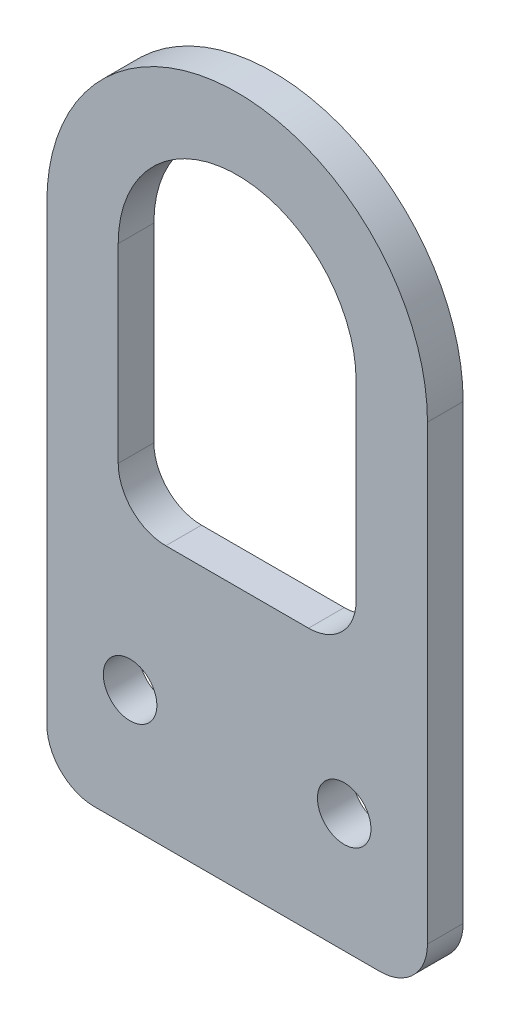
ISO-10303-21;
HEADER;
FILE_DESCRIPTION(('STEP AP214'),'2;1');
FILE_NAME('part.step','',(''),(''),'','','');
FILE_SCHEMA(('AUTOMOTIVE_DESIGN { 1 0 10303 214 1 1 1 1 }'));
ENDSEC;
DATA;
#1=APPLICATION_CONTEXT('core data for automotive mechanical design processes');
#2=APPLICATION_PROTOCOL_DEFINITION('international standard','automotive_design',2000,#1);
#3=PRODUCT_CONTEXT('',#1,'mechanical');
#4=PRODUCT('Part','Part','',(#3));
#5=PRODUCT_RELATED_PRODUCT_CATEGORY('part','',(#4));
#6=PRODUCT_DEFINITION_FORMATION('','',#4);
#7=PRODUCT_DEFINITION_CONTEXT('part definition',#1,'design');
#8=PRODUCT_DEFINITION('design','',#6,#7);
#9=PRODUCT_DEFINITION_SHAPE('','',#8);
#10=(LENGTH_UNIT() NAMED_UNIT(*) SI_UNIT(.MILLI.,.METRE.));
#11=(NAMED_UNIT(*) PLANE_ANGLE_UNIT() SI_UNIT($,.RADIAN.));
#12=(NAMED_UNIT(*) SI_UNIT($,.STERADIAN.) SOLID_ANGLE_UNIT());
#13=UNCERTAINTY_MEASURE_WITH_UNIT(LENGTH_MEASURE(1.E-05),#10,'distance_accuracy_value','');
#14=(GEOMETRIC_REPRESENTATION_CONTEXT(3) GLOBAL_UNCERTAINTY_ASSIGNED_CONTEXT((#13)) GLOBAL_UNIT_ASSIGNED_CONTEXT((#10,
#11,#12)) REPRESENTATION_CONTEXT('',''));
#15=CARTESIAN_POINT('',(0.,0.,0.));
#16=DIRECTION('',(0.,0.,1.));
#17=DIRECTION('',(1.,0.,0.));
#18=AXIS2_PLACEMENT_3D('',#15,#16,#17);
#19=CARTESIAN_POINT('',(-38.1,-139.7,9.525));
#20=DIRECTION('',(0.,0.,-1.));
#21=DIRECTION('',(-1.,0.,0.));
#22=AXIS2_PLACEMENT_3D('',#19,#20,#21);
#23=PLANE('',#22);
#24=CARTESIAN_POINT('',(-28.575,-120.65,9.525));
#25=DIRECTION('',(0.,0.,1.));
#26=DIRECTION('',(1.,0.,0.));
#27=AXIS2_PLACEMENT_3D('',#24,#25,#26);
#28=CIRCLE('',#27,7.14375000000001);
#29=CARTESIAN_POINT('',(-35.71875,-120.65,9.525));
#30=VERTEX_POINT('',#29);
#31=EDGE_CURVE('E182',#30,#30,#28,.T.);
#32=ORIENTED_EDGE('',*,*,#31,.F.);
#33=EDGE_LOOP('',(#32));
#34=FACE_BOUND('',#33,.T.);
#35=DIRECTION('',(0.,-1.,0.));
#36=VECTOR('',#35,1.);
#37=CARTESIAN_POINT('',(-50.8,-103.717375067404,9.525));
#38=LINE('',#37,#36);
#39=CARTESIAN_POINT('',(-50.8,-19.05,9.525));
#40=VERTEX_POINT('',#39);
#41=CARTESIAN_POINT('',(-50.8,-139.7,9.525));
#42=VERTEX_POINT('',#41);
#43=EDGE_CURVE('E133',#40,#42,#38,.T.);
#44=ORIENTED_EDGE('',*,*,#43,.T.);
#45=CARTESIAN_POINT('',(-38.1,-139.7,9.525));
#46=DIRECTION('',(0.,0.,1.));
#47=DIRECTION('',(-1.,0.,0.));
#48=AXIS2_PLACEMENT_3D('',#45,#46,#47);
#49=CIRCLE('',#48,12.7);
#50=CARTESIAN_POINT('',(-38.1,-152.4,9.525));
#51=VERTEX_POINT('',#50);
#52=EDGE_CURVE('E193',#42,#51,#49,.T.);
#53=ORIENTED_EDGE('',*,*,#52,.T.);
#54=DIRECTION('',(1.,0.,0.));
#55=VECTOR('',#54,1.);
#56=CARTESIAN_POINT('',(-38.1,-152.4,9.525));
#57=LINE('',#56,#55);
#58=CARTESIAN_POINT('',(38.1,-152.4,9.525));
#59=VERTEX_POINT('',#58);
#60=EDGE_CURVE('E54',#51,#59,#57,.T.);
#61=ORIENTED_EDGE('',*,*,#60,.T.);
#62=CARTESIAN_POINT('',(38.1,-139.7,9.525));
#63=DIRECTION('',(0.,0.,1.));
#64=DIRECTION('',(1.,0.,0.));
#65=AXIS2_PLACEMENT_3D('',#62,#63,#64);
#66=CIRCLE('',#65,12.7);
#67=CARTESIAN_POINT('',(50.8,-139.7,9.525));
#68=VERTEX_POINT('',#67);
#69=EDGE_CURVE('E49',#59,#68,#66,.T.);
#70=ORIENTED_EDGE('',*,*,#69,.T.);
#71=DIRECTION('',(0.,1.,0.));
#72=VECTOR('',#71,1.);
#73=CARTESIAN_POINT('',(50.8,-103.717375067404,9.525));
#74=LINE('',#73,#72);
#75=CARTESIAN_POINT('',(50.7999999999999,-19.05,9.525));
#76=VERTEX_POINT('',#75);
#77=EDGE_CURVE('E197',#68,#76,#74,.T.);
#78=ORIENTED_EDGE('',*,*,#77,.T.);
#79=CARTESIAN_POINT('',(0.,-19.05,9.525));
#80=DIRECTION('',(0.,0.,1.));
#81=DIRECTION('',(1.,0.,0.));
#82=AXIS2_PLACEMENT_3D('',#79,#80,#81);
#83=CIRCLE('',#82,50.7999999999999);
#84=EDGE_CURVE('E149',#76,#40,#83,.T.);
#85=ORIENTED_EDGE('',*,*,#84,.T.);
#86=EDGE_LOOP('',(#44,#53,#61,#70,#78,#85));
#87=FACE_BOUND('',#86,.T.);
#88=CARTESIAN_POINT('',(28.575,-120.65,9.525));
#89=DIRECTION('',(0.,0.,1.));
#90=DIRECTION('',(1.,0.,0.));
#91=AXIS2_PLACEMENT_3D('',#88,#89,#90);
#92=CIRCLE('',#91,7.14375);
#93=CARTESIAN_POINT('',(21.43125,-120.65,9.525));
#94=VERTEX_POINT('',#93);
#95=EDGE_CURVE('E175',#94,#94,#92,.T.);
#96=ORIENTED_EDGE('',*,*,#95,.F.);
#97=EDGE_LOOP('',(#96));
#98=FACE_BOUND('',#97,.T.);
#99=CARTESIAN_POINT('',(0.,-19.05,9.525));
#100=DIRECTION('',(0.,0.,1.));
#101=DIRECTION('',(1.,0.,0.));
#102=AXIS2_PLACEMENT_3D('',#99,#100,#101);
#103=CIRCLE('',#102,31.75);
#104=CARTESIAN_POINT('',(31.75,-19.05,9.525));
#105=VERTEX_POINT('',#104);
#106=CARTESIAN_POINT('',(-31.75,-19.05,9.525));
#107=VERTEX_POINT('',#106);
#108=EDGE_CURVE('E152',#105,#107,#103,.T.);
#109=ORIENTED_EDGE('',*,*,#108,.F.);
#110=DIRECTION('',(0.,1.,0.));
#111=VECTOR('',#110,1.);
#112=CARTESIAN_POINT('',(31.75,-19.05,9.525));
#113=LINE('',#112,#111);
#114=CARTESIAN_POINT('',(31.75,-69.85,9.525));
#115=VERTEX_POINT('',#114);
#116=EDGE_CURVE('E159',#115,#105,#113,.T.);
#117=ORIENTED_EDGE('',*,*,#116,.F.);
#118=CARTESIAN_POINT('',(19.05,-69.85,9.525));
#119=DIRECTION('',(0.,0.,1.));
#120=DIRECTION('',(1.,0.,0.));
#121=AXIS2_PLACEMENT_3D('',#118,#119,#120);
#122=CIRCLE('',#121,12.7);
#123=CARTESIAN_POINT('',(19.05,-82.55,9.525));
#124=VERTEX_POINT('',#123);
#125=EDGE_CURVE('E162',#124,#115,#122,.T.);
#126=ORIENTED_EDGE('',*,*,#125,.F.);
#127=DIRECTION('',(1.,0.,0.));
#128=VECTOR('',#127,1.);
#129=CARTESIAN_POINT('',(-19.05,-82.55,9.525));
#130=LINE('',#129,#128);
#131=CARTESIAN_POINT('',(-19.05,-82.55,9.525));
#132=VERTEX_POINT('',#131);
#133=EDGE_CURVE('E165',#132,#124,#130,.T.);
#134=ORIENTED_EDGE('',*,*,#133,.F.);
#135=CARTESIAN_POINT('',(-19.05,-69.85,9.525));
#136=DIRECTION('',(0.,0.,1.));
#137=DIRECTION('',(-1.,0.,0.));
#138=AXIS2_PLACEMENT_3D('',#135,#136,#137);
#139=CIRCLE('',#138,12.7);
#140=CARTESIAN_POINT('',(-31.75,-69.85,9.525));
#141=VERTEX_POINT('',#140);
#142=EDGE_CURVE('E168',#141,#132,#139,.T.);
#143=ORIENTED_EDGE('',*,*,#142,.F.);
#144=DIRECTION('',(0.,-1.,0.));
#145=VECTOR('',#144,1.);
#146=CARTESIAN_POINT('',(-31.75,-19.05,9.525));
#147=LINE('',#146,#145);
#148=EDGE_CURVE('E171',#107,#141,#147,.T.);
#149=ORIENTED_EDGE('',*,*,#148,.F.);
#150=EDGE_LOOP('',(#109,#117,#126,#134,#143,#149));
#151=FACE_BOUND('',#150,.T.);
#152=ADVANCED_FACE('F34',(#34,#87,#98,#151),#23,.F.);
#153=CARTESIAN_POINT('',(-38.1,-139.7,0.));
#154=DIRECTION('',(0.,0.,-1.));
#155=DIRECTION('',(-1.,0.,0.));
#156=AXIS2_PLACEMENT_3D('',#153,#154,#155);
#157=PLANE('',#156);
#158=CARTESIAN_POINT('',(-28.575,-120.65,0.));
#159=DIRECTION('',(0.,0.,1.));
#160=DIRECTION('',(1.,0.,0.));
#161=AXIS2_PLACEMENT_3D('',#158,#159,#160);
#162=CIRCLE('',#161,7.14375000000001);
#163=CARTESIAN_POINT('',(-35.71875,-120.65,0.));
#164=VERTEX_POINT('',#163);
#165=EDGE_CURVE('E179',#164,#164,#162,.T.);
#166=ORIENTED_EDGE('',*,*,#165,.T.);
#167=EDGE_LOOP('',(#166));
#168=FACE_BOUND('',#167,.T.);
#169=DIRECTION('',(0.,-1.,0.));
#170=VECTOR('',#169,1.);
#171=CARTESIAN_POINT('',(-50.8,-103.717375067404,0.));
#172=LINE('',#171,#170);
#173=CARTESIAN_POINT('',(-50.8,-19.05,0.));
#174=VERTEX_POINT('',#173);
#175=CARTESIAN_POINT('',(-50.8,-139.7,0.));
#176=VERTEX_POINT('',#175);
#177=EDGE_CURVE('E141',#174,#176,#172,.T.);
#178=ORIENTED_EDGE('',*,*,#177,.F.);
#179=CARTESIAN_POINT('',(0.,-19.05,0.));
#180=DIRECTION('',(0.,0.,-1.));
#181=DIRECTION('',(-1.,0.,0.));
#182=AXIS2_PLACEMENT_3D('',#179,#180,#181);
#183=CIRCLE('',#182,50.7999999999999);
#184=CARTESIAN_POINT('',(50.7999999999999,-19.05,0.));
#185=VERTEX_POINT('',#184);
#186=EDGE_CURVE('E137',#185,#174,#183,.F.);
#187=ORIENTED_EDGE('',*,*,#186,.F.);
#188=DIRECTION('',(0.,1.,0.));
#189=VECTOR('',#188,1.);
#190=CARTESIAN_POINT('',(50.8,-103.717375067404,0.));
#191=LINE('',#190,#189);
#192=CARTESIAN_POINT('',(50.8,-139.7,0.));
#193=VERTEX_POINT('',#192);
#194=EDGE_CURVE('E123',#193,#185,#191,.T.);
#195=ORIENTED_EDGE('',*,*,#194,.F.);
#196=CARTESIAN_POINT('',(38.1,-139.7,0.));
#197=DIRECTION('',(0.,0.,1.));
#198=DIRECTION('',(1.,0.,0.));
#199=AXIS2_PLACEMENT_3D('',#196,#197,#198);
#200=CIRCLE('',#199,12.7);
#201=CARTESIAN_POINT('',(38.1,-152.4,0.));
#202=VERTEX_POINT('',#201);
#203=EDGE_CURVE('E134',#202,#193,#200,.T.);
#204=ORIENTED_EDGE('',*,*,#203,.F.);
#205=DIRECTION('',(1.,0.,0.));
#206=VECTOR('',#205,1.);
#207=CARTESIAN_POINT('',(-38.1,-152.4,0.));
#208=LINE('',#207,#206);
#209=CARTESIAN_POINT('',(-38.1,-152.4,0.));
#210=VERTEX_POINT('',#209);
#211=EDGE_CURVE('E188',#210,#202,#208,.T.);
#212=ORIENTED_EDGE('',*,*,#211,.F.);
#213=CARTESIAN_POINT('',(-38.1,-139.7,0.));
#214=DIRECTION('',(0.,0.,1.));
#215=DIRECTION('',(-1.,0.,0.));
#216=AXIS2_PLACEMENT_3D('',#213,#214,#215);
#217=CIRCLE('',#216,12.7);
#218=EDGE_CURVE('E186',#176,#210,#217,.T.);
#219=ORIENTED_EDGE('',*,*,#218,.F.);
#220=EDGE_LOOP('',(#178,#187,#195,#204,#212,#219));
#221=FACE_BOUND('',#220,.T.);
#222=CARTESIAN_POINT('',(28.575,-120.65,0.));
#223=DIRECTION('',(0.,0.,1.));
#224=DIRECTION('',(1.,0.,0.));
#225=AXIS2_PLACEMENT_3D('',#222,#223,#224);
#226=CIRCLE('',#225,7.14375);
#227=CARTESIAN_POINT('',(21.43125,-120.65,0.));
#228=VERTEX_POINT('',#227);
#229=EDGE_CURVE('E172',#228,#228,#226,.T.);
#230=ORIENTED_EDGE('',*,*,#229,.T.);
#231=EDGE_LOOP('',(#230));
#232=FACE_BOUND('',#231,.T.);
#233=DIRECTION('',(0.,1.,0.));
#234=VECTOR('',#233,1.);
#235=CARTESIAN_POINT('',(31.75,-19.05,0.));
#236=LINE('',#235,#234);
#237=CARTESIAN_POINT('',(31.75,-69.85,0.));
#238=VERTEX_POINT('',#237);
#239=CARTESIAN_POINT('',(31.75,-19.05,0.));
#240=VERTEX_POINT('',#239);
#241=EDGE_CURVE('E212',#238,#240,#236,.T.);
#242=ORIENTED_EDGE('',*,*,#241,.T.);
#243=CARTESIAN_POINT('',(0.,-19.05,0.));
#244=DIRECTION('',(0.,0.,-1.));
#245=DIRECTION('',(-1.,0.,0.));
#246=AXIS2_PLACEMENT_3D('',#243,#244,#245);
#247=CIRCLE('',#246,31.75);
#248=CARTESIAN_POINT('',(-31.75,-19.05,0.));
#249=VERTEX_POINT('',#248);
#250=EDGE_CURVE('E215',#240,#249,#247,.F.);
#251=ORIENTED_EDGE('',*,*,#250,.T.);
#252=DIRECTION('',(0.,-1.,0.));
#253=VECTOR('',#252,1.);
#254=CARTESIAN_POINT('',(-31.75,-19.05,0.));
#255=LINE('',#254,#253);
#256=CARTESIAN_POINT('',(-31.75,-69.85,0.));
#257=VERTEX_POINT('',#256);
#258=EDGE_CURVE('E231',#249,#257,#255,.T.);
#259=ORIENTED_EDGE('',*,*,#258,.T.);
#260=CARTESIAN_POINT('',(-19.05,-69.85,0.));
#261=DIRECTION('',(0.,0.,-1.));
#262=DIRECTION('',(-1.,0.,0.));
#263=AXIS2_PLACEMENT_3D('',#260,#261,#262);
#264=CIRCLE('',#263,12.7);
#265=CARTESIAN_POINT('',(-19.05,-82.55,0.));
#266=VERTEX_POINT('',#265);
#267=EDGE_CURVE('E238',#257,#266,#264,.F.);
#268=ORIENTED_EDGE('',*,*,#267,.T.);
#269=DIRECTION('',(1.,0.,0.));
#270=VECTOR('',#269,1.);
#271=CARTESIAN_POINT('',(-19.05,-82.55,0.));
#272=LINE('',#271,#270);
#273=CARTESIAN_POINT('',(19.05,-82.55,0.));
#274=VERTEX_POINT('',#273);
#275=EDGE_CURVE('E235',#266,#274,#272,.T.);
#276=ORIENTED_EDGE('',*,*,#275,.T.);
#277=CARTESIAN_POINT('',(19.05,-69.85,0.));
#278=DIRECTION('',(0.,0.,-1.));
#279=DIRECTION('',(-1.,0.,0.));
#280=AXIS2_PLACEMENT_3D('',#277,#278,#279);
#281=CIRCLE('',#280,12.7);
#282=EDGE_CURVE('E176',#274,#238,#281,.F.);
#283=ORIENTED_EDGE('',*,*,#282,.T.);
#284=EDGE_LOOP('',(#242,#251,#259,#268,#276,#283));
#285=FACE_BOUND('',#284,.T.);
#286=ADVANCED_FACE('F138',(#168,#221,#232,#285),#157,.T.);
#287=CARTESIAN_POINT('',(-50.8,-103.717375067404,9.525));
#288=DIRECTION('',(1.,0.,0.));
#289=DIRECTION('',(0.,1.,0.));
#290=AXIS2_PLACEMENT_3D('',#287,#288,#289);
#291=PLANE('',#290);
#292=ORIENTED_EDGE('',*,*,#177,.T.);
#293=DIRECTION('',(0.,0.,-1.));
#294=VECTOR('',#293,1.);
#295=CARTESIAN_POINT('',(-50.8,-139.7,9.525));
#296=LINE('',#295,#294);
#297=EDGE_CURVE('E11',#42,#176,#296,.T.);
#298=ORIENTED_EDGE('',*,*,#297,.F.);
#299=ORIENTED_EDGE('',*,*,#43,.F.);
#300=DIRECTION('',(0.,0.,1.));
#301=VECTOR('',#300,1.);
#302=CARTESIAN_POINT('',(-50.8,-19.05,-169.333900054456));
#303=LINE('',#302,#301);
#304=EDGE_CURVE('E145',#174,#40,#303,.T.);
#305=ORIENTED_EDGE('',*,*,#304,.F.);
#306=EDGE_LOOP('',(#292,#298,#299,#305));
#307=FACE_BOUND('',#306,.T.);
#308=ADVANCED_FACE('F36',(#307),#291,.F.);
#309=CARTESIAN_POINT('',(-38.1,-139.7,9.525));
#310=DIRECTION('',(0.,0.,-1.));
#311=DIRECTION('',(-1.,0.,0.));
#312=AXIS2_PLACEMENT_3D('',#309,#310,#311);
#313=CYLINDRICAL_SURFACE('',#312,12.7);
#314=ORIENTED_EDGE('',*,*,#218,.T.);
#315=DIRECTION('',(0.,0.,-1.));
#316=VECTOR('',#315,1.);
#317=CARTESIAN_POINT('',(-38.1,-152.4,9.525));
#318=LINE('',#317,#316);
#319=EDGE_CURVE('E42',#51,#210,#318,.T.);
#320=ORIENTED_EDGE('',*,*,#319,.F.);
#321=ORIENTED_EDGE('',*,*,#52,.F.);
#322=ORIENTED_EDGE('',*,*,#297,.T.);
#323=EDGE_LOOP('',(#314,#320,#321,#322));
#324=FACE_BOUND('',#323,.T.);
#325=ADVANCED_FACE('F284',(#324),#313,.T.);
#326=CARTESIAN_POINT('',(-38.1,-152.4,9.525));
#327=DIRECTION('',(0.,1.,0.));
#328=DIRECTION('',(0.,0.,1.));
#329=AXIS2_PLACEMENT_3D('',#326,#327,#328);
#330=PLANE('',#329);
#331=ORIENTED_EDGE('',*,*,#211,.T.);
#332=DIRECTION('',(0.,0.,-1.));
#333=VECTOR('',#332,1.);
#334=CARTESIAN_POINT('',(38.1,-152.4,9.525));
#335=LINE('',#334,#333);
#336=EDGE_CURVE('E200',#59,#202,#335,.T.);
#337=ORIENTED_EDGE('',*,*,#336,.F.);
#338=ORIENTED_EDGE('',*,*,#60,.F.);
#339=ORIENTED_EDGE('',*,*,#319,.T.);
#340=EDGE_LOOP('',(#331,#337,#338,#339));
#341=FACE_BOUND('',#340,.T.);
#342=ADVANCED_FACE('F206',(#341),#330,.F.);
#343=CARTESIAN_POINT('',(38.1,-139.7,9.525));
#344=DIRECTION('',(0.,0.,-1.));
#345=DIRECTION('',(-1.,0.,0.));
#346=AXIS2_PLACEMENT_3D('',#343,#344,#345);
#347=CYLINDRICAL_SURFACE('',#346,12.7);
#348=ORIENTED_EDGE('',*,*,#203,.T.);
#349=DIRECTION('',(0.,0.,-1.));
#350=VECTOR('',#349,1.);
#351=CARTESIAN_POINT('',(50.8,-139.7,9.525));
#352=LINE('',#351,#350);
#353=EDGE_CURVE('E130',#68,#193,#352,.T.);
#354=ORIENTED_EDGE('',*,*,#353,.F.);
#355=ORIENTED_EDGE('',*,*,#69,.F.);
#356=ORIENTED_EDGE('',*,*,#336,.T.);
#357=EDGE_LOOP('',(#348,#354,#355,#356));
#358=FACE_BOUND('',#357,.T.);
#359=ADVANCED_FACE('F209',(#358),#347,.T.);
#360=CARTESIAN_POINT('',(50.8,-103.717375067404,9.525));
#361=DIRECTION('',(-1.,0.,0.));
#362=DIRECTION('',(0.,0.,1.));
#363=AXIS2_PLACEMENT_3D('',#360,#361,#362);
#364=PLANE('',#363);
#365=ORIENTED_EDGE('',*,*,#194,.T.);
#366=DIRECTION('',(0.,0.,1.));
#367=VECTOR('',#366,1.);
#368=CARTESIAN_POINT('',(50.7999999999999,-19.05,-169.333900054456));
#369=LINE('',#368,#367);
#370=EDGE_CURVE('E128',#185,#76,#369,.T.);
#371=ORIENTED_EDGE('',*,*,#370,.T.);
#372=ORIENTED_EDGE('',*,*,#77,.F.);
#373=ORIENTED_EDGE('',*,*,#353,.T.);
#374=EDGE_LOOP('',(#365,#371,#372,#373));
#375=FACE_BOUND('',#374,.T.);
#376=ADVANCED_FACE('F125',(#375),#364,.F.);
#377=CARTESIAN_POINT('',(-28.575,-120.65,9.525));
#378=DIRECTION('',(0.,0.,-1.));
#379=DIRECTION('',(-1.,0.,0.));
#380=AXIS2_PLACEMENT_3D('',#377,#378,#379);
#381=CYLINDRICAL_SURFACE('',#380,7.14375000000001);
#382=CARTESIAN_POINT('',(-35.71875,-120.65,9.525));
#383=CARTESIAN_POINT('',(-35.71875,-120.65,9.42578125));
#384=CARTESIAN_POINT('',(-35.71875,-120.65,9.3265625));
#385=CARTESIAN_POINT('',(-35.71875,-120.65,9.128125));
#386=CARTESIAN_POINT('',(-35.71875,-120.65,9.02890625));
#387=CARTESIAN_POINT('',(-35.71875,-120.65,8.83046875));
#388=CARTESIAN_POINT('',(-35.71875,-120.65,8.73125));
#389=CARTESIAN_POINT('',(-35.71875,-120.65,8.5328125));
#390=CARTESIAN_POINT('',(-35.71875,-120.65,8.43359375));
#391=CARTESIAN_POINT('',(-35.71875,-120.65,8.23515625));
#392=CARTESIAN_POINT('',(-35.71875,-120.65,8.1359375));
#393=CARTESIAN_POINT('',(-35.71875,-120.65,7.9375));
#394=CARTESIAN_POINT('',(-35.71875,-120.65,7.83828125));
#395=CARTESIAN_POINT('',(-35.71875,-120.65,7.63984375));
#396=CARTESIAN_POINT('',(-35.71875,-120.65,7.540625));
#397=CARTESIAN_POINT('',(-35.71875,-120.65,7.3421875));
#398=CARTESIAN_POINT('',(-35.71875,-120.65,7.24296875));
#399=CARTESIAN_POINT('',(-35.71875,-120.65,7.04453125));
#400=CARTESIAN_POINT('',(-35.71875,-120.65,6.9453125));
#401=CARTESIAN_POINT('',(-35.71875,-120.65,6.746875));
#402=CARTESIAN_POINT('',(-35.71875,-120.65,6.64765625));
#403=CARTESIAN_POINT('',(-35.71875,-120.65,6.44921875));
#404=CARTESIAN_POINT('',(-35.71875,-120.65,6.35));
#405=CARTESIAN_POINT('',(-35.71875,-120.65,6.1515625));
#406=CARTESIAN_POINT('',(-35.71875,-120.65,6.05234375));
#407=CARTESIAN_POINT('',(-35.71875,-120.65,5.85390625));
#408=CARTESIAN_POINT('',(-35.71875,-120.65,5.7546875));
#409=CARTESIAN_POINT('',(-35.71875,-120.65,5.55625));
#410=CARTESIAN_POINT('',(-35.71875,-120.65,5.45703125));
#411=CARTESIAN_POINT('',(-35.71875,-120.65,5.25859375));
#412=CARTESIAN_POINT('',(-35.71875,-120.65,5.159375));
#413=CARTESIAN_POINT('',(-35.71875,-120.65,4.9609375));
#414=CARTESIAN_POINT('',(-35.71875,-120.65,4.86171875));
#415=CARTESIAN_POINT('',(-35.71875,-120.65,4.66328125));
#416=CARTESIAN_POINT('',(-35.71875,-120.65,4.5640625));
#417=CARTESIAN_POINT('',(-35.71875,-120.65,4.365625));
#418=CARTESIAN_POINT('',(-35.71875,-120.65,4.26640625));
#419=CARTESIAN_POINT('',(-35.71875,-120.65,4.06796875));
#420=CARTESIAN_POINT('',(-35.71875,-120.65,3.96875));
#421=CARTESIAN_POINT('',(-35.71875,-120.65,3.7703125));
#422=CARTESIAN_POINT('',(-35.71875,-120.65,3.67109375));
#423=CARTESIAN_POINT('',(-35.71875,-120.65,3.47265625));
#424=CARTESIAN_POINT('',(-35.71875,-120.65,3.3734375));
#425=CARTESIAN_POINT('',(-35.71875,-120.65,3.175));
#426=CARTESIAN_POINT('',(-35.71875,-120.65,3.07578125));
#427=CARTESIAN_POINT('',(-35.71875,-120.65,2.87734375));
#428=CARTESIAN_POINT('',(-35.71875,-120.65,2.778125));
#429=CARTESIAN_POINT('',(-35.71875,-120.65,2.5796875));
#430=CARTESIAN_POINT('',(-35.71875,-120.65,2.48046875));
#431=CARTESIAN_POINT('',(-35.71875,-120.65,2.28203125));
#432=CARTESIAN_POINT('',(-35.71875,-120.65,2.1828125));
#433=CARTESIAN_POINT('',(-35.71875,-120.65,1.984375));
#434=CARTESIAN_POINT('',(-35.71875,-120.65,1.88515625));
#435=CARTESIAN_POINT('',(-35.71875,-120.65,1.68671875));
#436=CARTESIAN_POINT('',(-35.71875,-120.65,1.5875));
#437=CARTESIAN_POINT('',(-35.71875,-120.65,1.3890625));
#438=CARTESIAN_POINT('',(-35.71875,-120.65,1.28984375));
#439=CARTESIAN_POINT('',(-35.71875,-120.65,1.09140625));
#440=CARTESIAN_POINT('',(-35.71875,-120.65,0.992187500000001));
#441=CARTESIAN_POINT('',(-35.71875,-120.65,0.793750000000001));
#442=CARTESIAN_POINT('',(-35.71875,-120.65,0.69453125));
#443=CARTESIAN_POINT('',(-35.71875,-120.65,0.49609375));
#444=CARTESIAN_POINT('',(-35.71875,-120.65,0.396875));
#445=CARTESIAN_POINT('',(-35.71875,-120.65,0.1984375));
#446=CARTESIAN_POINT('',(-35.71875,-120.65,0.0992187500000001));
#447=CARTESIAN_POINT('',(-35.71875,-120.65,0.));
#448=B_SPLINE_CURVE_WITH_KNOTS('',3,(#382,#383,#384,#385,#386,#387,#388,#389,#390,#391,#392,
#393,#394,#395,#396,#397,#398,#399,#400,#401,#402,#403,#404,#405,#406,#407,#408,#409,#410,#411,
#412,#413,#414,#415,#416,#417,#418,#419,#420,#421,#422,#423,#424,#425,#426,#427,#428,#429,#430,
#431,#432,#433,#434,#435,#436,#437,#438,#439,#440,#441,#442,#443,#444,#445,#446,#447),
.UNSPECIFIED.,.F.,.F.,(4,2,2,2,2,2,2,2,2,2,2,2,2,2,2,2,2,2,2,2,2,2,2,2,2,2,2,2,2,2,2,2,4),(0.,
0.29765625,0.5953125,0.892968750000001,1.190625,1.48828125,1.7859375,2.08359375,2.38125,
2.67890625,2.9765625,3.27421875,3.571875,3.86953125,4.1671875,4.46484375,4.7625,5.06015625,
5.3578125,5.65546875,5.953125,6.25078125,6.5484375,6.84609375,7.14375,7.44140625,7.7390625,
8.03671875,8.334375,8.63203125,8.9296875,9.22734375,9.525),.UNSPECIFIED.);
#449=EDGE_CURVE('BSEAM280',#30,#164,#448,.T.);
#450=ORIENTED_EDGE('',*,*,#31,.T.);
#451=ORIENTED_EDGE('',*,*,#165,.F.);
#452=ORIENTED_EDGE('',*,*,#449,.T.);
#453=ORIENTED_EDGE('',*,*,#449,.F.);
#454=EDGE_LOOP('',(#450,#452,#451,#453));
#455=FACE_BOUND('',#454,.T.);
#456=ADVANCED_FACE('F280',(#455),#381,.F.);
#457=CARTESIAN_POINT('',(28.575,-120.65,9.525));
#458=DIRECTION('',(0.,0.,-1.));
#459=DIRECTION('',(-1.,0.,0.));
#460=AXIS2_PLACEMENT_3D('',#457,#458,#459);
#461=CYLINDRICAL_SURFACE('',#460,7.14375);
#462=CARTESIAN_POINT('',(21.43125,-120.65,9.525));
#463=CARTESIAN_POINT('',(21.43125,-120.65,9.42578125));
#464=CARTESIAN_POINT('',(21.43125,-120.65,9.3265625));
#465=CARTESIAN_POINT('',(21.43125,-120.65,9.128125));
#466=CARTESIAN_POINT('',(21.43125,-120.65,9.02890625));
#467=CARTESIAN_POINT('',(21.43125,-120.65,8.83046875));
#468=CARTESIAN_POINT('',(21.43125,-120.65,8.73125));
#469=CARTESIAN_POINT('',(21.43125,-120.65,8.5328125));
#470=CARTESIAN_POINT('',(21.43125,-120.65,8.43359375));
#471=CARTESIAN_POINT('',(21.43125,-120.65,8.23515625));
#472=CARTESIAN_POINT('',(21.43125,-120.65,8.1359375));
#473=CARTESIAN_POINT('',(21.43125,-120.65,7.9375));
#474=CARTESIAN_POINT('',(21.43125,-120.65,7.83828125));
#475=CARTESIAN_POINT('',(21.43125,-120.65,7.63984375));
#476=CARTESIAN_POINT('',(21.43125,-120.65,7.540625));
#477=CARTESIAN_POINT('',(21.43125,-120.65,7.3421875));
#478=CARTESIAN_POINT('',(21.43125,-120.65,7.24296875));
#479=CARTESIAN_POINT('',(21.43125,-120.65,7.04453125));
#480=CARTESIAN_POINT('',(21.43125,-120.65,6.9453125));
#481=CARTESIAN_POINT('',(21.43125,-120.65,6.746875));
#482=CARTESIAN_POINT('',(21.43125,-120.65,6.64765625));
#483=CARTESIAN_POINT('',(21.43125,-120.65,6.44921875));
#484=CARTESIAN_POINT('',(21.43125,-120.65,6.35));
#485=CARTESIAN_POINT('',(21.43125,-120.65,6.1515625));
#486=CARTESIAN_POINT('',(21.43125,-120.65,6.05234375));
#487=CARTESIAN_POINT('',(21.43125,-120.65,5.85390625));
#488=CARTESIAN_POINT('',(21.43125,-120.65,5.7546875));
#489=CARTESIAN_POINT('',(21.43125,-120.65,5.55625));
#490=CARTESIAN_POINT('',(21.43125,-120.65,5.45703125));
#491=CARTESIAN_POINT('',(21.43125,-120.65,5.25859375));
#492=CARTESIAN_POINT('',(21.43125,-120.65,5.159375));
#493=CARTESIAN_POINT('',(21.43125,-120.65,4.9609375));
#494=CARTESIAN_POINT('',(21.43125,-120.65,4.86171875));
#495=CARTESIAN_POINT('',(21.43125,-120.65,4.66328125));
#496=CARTESIAN_POINT('',(21.43125,-120.65,4.5640625));
#497=CARTESIAN_POINT('',(21.43125,-120.65,4.365625));
#498=CARTESIAN_POINT('',(21.43125,-120.65,4.26640625));
#499=CARTESIAN_POINT('',(21.43125,-120.65,4.06796875));
#500=CARTESIAN_POINT('',(21.43125,-120.65,3.96875));
#501=CARTESIAN_POINT('',(21.43125,-120.65,3.7703125));
#502=CARTESIAN_POINT('',(21.43125,-120.65,3.67109375));
#503=CARTESIAN_POINT('',(21.43125,-120.65,3.47265625));
#504=CARTESIAN_POINT('',(21.43125,-120.65,3.3734375));
#505=CARTESIAN_POINT('',(21.43125,-120.65,3.175));
#506=CARTESIAN_POINT('',(21.43125,-120.65,3.07578125));
#507=CARTESIAN_POINT('',(21.43125,-120.65,2.87734375));
#508=CARTESIAN_POINT('',(21.43125,-120.65,2.778125));
#509=CARTESIAN_POINT('',(21.43125,-120.65,2.5796875));
#510=CARTESIAN_POINT('',(21.43125,-120.65,2.48046875));
#511=CARTESIAN_POINT('',(21.43125,-120.65,2.28203125));
#512=CARTESIAN_POINT('',(21.43125,-120.65,2.1828125));
#513=CARTESIAN_POINT('',(21.43125,-120.65,1.984375));
#514=CARTESIAN_POINT('',(21.43125,-120.65,1.88515625));
#515=CARTESIAN_POINT('',(21.43125,-120.65,1.68671875));
#516=CARTESIAN_POINT('',(21.43125,-120.65,1.5875));
#517=CARTESIAN_POINT('',(21.43125,-120.65,1.3890625));
#518=CARTESIAN_POINT('',(21.43125,-120.65,1.28984375));
#519=CARTESIAN_POINT('',(21.43125,-120.65,1.09140625));
#520=CARTESIAN_POINT('',(21.43125,-120.65,0.992187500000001));
#521=CARTESIAN_POINT('',(21.43125,-120.65,0.793750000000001));
#522=CARTESIAN_POINT('',(21.43125,-120.65,0.69453125));
#523=CARTESIAN_POINT('',(21.43125,-120.65,0.49609375));
#524=CARTESIAN_POINT('',(21.43125,-120.65,0.396875));
#525=CARTESIAN_POINT('',(21.43125,-120.65,0.1984375));
#526=CARTESIAN_POINT('',(21.43125,-120.65,0.0992187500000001));
#527=CARTESIAN_POINT('',(21.43125,-120.65,0.));
#528=B_SPLINE_CURVE_WITH_KNOTS('',3,(#462,#463,#464,#465,#466,#467,#468,#469,#470,#471,#472,
#473,#474,#475,#476,#477,#478,#479,#480,#481,#482,#483,#484,#485,#486,#487,#488,#489,#490,#491,
#492,#493,#494,#495,#496,#497,#498,#499,#500,#501,#502,#503,#504,#505,#506,#507,#508,#509,#510,
#511,#512,#513,#514,#515,#516,#517,#518,#519,#520,#521,#522,#523,#524,#525,#526,#527),
.UNSPECIFIED.,.F.,.F.,(4,2,2,2,2,2,2,2,2,2,2,2,2,2,2,2,2,2,2,2,2,2,2,2,2,2,2,2,2,2,2,2,4),(0.,
0.29765625,0.5953125,0.892968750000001,1.190625,1.48828125,1.7859375,2.08359375,2.38125,
2.67890625,2.9765625,3.27421875,3.571875,3.86953125,4.1671875,4.46484375,4.7625,5.06015625,
5.3578125,5.65546875,5.953125,6.25078125,6.5484375,6.84609375,7.14375,7.44140625,7.7390625,
8.03671875,8.334375,8.63203125,8.9296875,9.22734375,9.525),.UNSPECIFIED.);
#529=EDGE_CURVE('BSEAM309',#94,#228,#528,.T.);
#530=ORIENTED_EDGE('',*,*,#95,.T.);
#531=ORIENTED_EDGE('',*,*,#229,.F.);
#532=ORIENTED_EDGE('',*,*,#529,.T.);
#533=ORIENTED_EDGE('',*,*,#529,.F.);
#534=EDGE_LOOP('',(#530,#532,#531,#533));
#535=FACE_BOUND('',#534,.T.);
#536=ADVANCED_FACE('F309',(#535),#461,.F.);
#537=CARTESIAN_POINT('',(0.,-19.05,-169.333900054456));
#538=DIRECTION('',(0.,0.,1.));
#539=DIRECTION('',(1.,0.,0.));
#540=AXIS2_PLACEMENT_3D('',#537,#538,#539);
#541=CYLINDRICAL_SURFACE('',#540,50.7999999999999);
#542=ORIENTED_EDGE('',*,*,#370,.F.);
#543=ORIENTED_EDGE('',*,*,#186,.T.);
#544=ORIENTED_EDGE('',*,*,#304,.T.);
#545=ORIENTED_EDGE('',*,*,#84,.F.);
#546=EDGE_LOOP('',(#542,#543,#544,#545));
#547=FACE_BOUND('',#546,.T.);
#548=ADVANCED_FACE('F147',(#547),#541,.T.);
#549=CARTESIAN_POINT('',(0.,-19.05,-169.333900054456));
#550=DIRECTION('',(0.,0.,1.));
#551=DIRECTION('',(1.,0.,0.));
#552=AXIS2_PLACEMENT_3D('',#549,#550,#551);
#553=CYLINDRICAL_SURFACE('',#552,31.75);
#554=ORIENTED_EDGE('',*,*,#250,.F.);
#555=DIRECTION('',(0.,0.,1.));
#556=VECTOR('',#555,1.);
#557=CARTESIAN_POINT('',(31.75,-19.05,-169.333900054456));
#558=LINE('',#557,#556);
#559=EDGE_CURVE('E150',#240,#105,#558,.T.);
#560=ORIENTED_EDGE('',*,*,#559,.T.);
#561=ORIENTED_EDGE('',*,*,#108,.T.);
#562=DIRECTION('',(0.,0.,1.));
#563=VECTOR('',#562,1.);
#564=CARTESIAN_POINT('',(-31.75,-19.05,-169.333900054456));
#565=LINE('',#564,#563);
#566=EDGE_CURVE('E169',#249,#107,#565,.T.);
#567=ORIENTED_EDGE('',*,*,#566,.F.);
#568=EDGE_LOOP('',(#554,#560,#561,#567));
#569=FACE_BOUND('',#568,.T.);
#570=ADVANCED_FACE('F265',(#569),#553,.F.);
#571=CARTESIAN_POINT('',(31.75,-19.05,-169.333900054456));
#572=DIRECTION('',(1.,0.,0.));
#573=DIRECTION('',(0.,1.,0.));
#574=AXIS2_PLACEMENT_3D('',#571,#572,#573);
#575=PLANE('',#574);
#576=ORIENTED_EDGE('',*,*,#241,.F.);
#577=DIRECTION('',(0.,0.,1.));
#578=VECTOR('',#577,1.);
#579=CARTESIAN_POINT('',(31.75,-69.85,-169.333900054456));
#580=LINE('',#579,#578);
#581=EDGE_CURVE('E157',#238,#115,#580,.T.);
#582=ORIENTED_EDGE('',*,*,#581,.T.);
#583=ORIENTED_EDGE('',*,*,#116,.T.);
#584=ORIENTED_EDGE('',*,*,#559,.F.);
#585=EDGE_LOOP('',(#576,#582,#583,#584));
#586=FACE_BOUND('',#585,.T.);
#587=ADVANCED_FACE('F261',(#586),#575,.F.);
#588=CARTESIAN_POINT('',(19.05,-69.85,-169.333900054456));
#589=DIRECTION('',(0.,0.,1.));
#590=DIRECTION('',(1.,0.,0.));
#591=AXIS2_PLACEMENT_3D('',#588,#589,#590);
#592=CYLINDRICAL_SURFACE('',#591,12.7);
#593=ORIENTED_EDGE('',*,*,#282,.F.);
#594=DIRECTION('',(0.,0.,1.));
#595=VECTOR('',#594,1.);
#596=CARTESIAN_POINT('',(19.05,-82.55,-169.333900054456));
#597=LINE('',#596,#595);
#598=EDGE_CURVE('E160',#274,#124,#597,.T.);
#599=ORIENTED_EDGE('',*,*,#598,.T.);
#600=ORIENTED_EDGE('',*,*,#125,.T.);
#601=ORIENTED_EDGE('',*,*,#581,.F.);
#602=EDGE_LOOP('',(#593,#599,#600,#601));
#603=FACE_BOUND('',#602,.T.);
#604=ADVANCED_FACE('F258',(#603),#592,.F.);
#605=CARTESIAN_POINT('',(-19.05,-82.55,-169.333900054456));
#606=DIRECTION('',(0.,-1.,0.));
#607=DIRECTION('',(1.,0.,0.));
#608=AXIS2_PLACEMENT_3D('',#605,#606,#607);
#609=PLANE('',#608);
#610=ORIENTED_EDGE('',*,*,#275,.F.);
#611=DIRECTION('',(0.,0.,1.));
#612=VECTOR('',#611,1.);
#613=CARTESIAN_POINT('',(-19.05,-82.55,-169.333900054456));
#614=LINE('',#613,#612);
#615=EDGE_CURVE('E163',#266,#132,#614,.T.);
#616=ORIENTED_EDGE('',*,*,#615,.T.);
#617=ORIENTED_EDGE('',*,*,#133,.T.);
#618=ORIENTED_EDGE('',*,*,#598,.F.);
#619=EDGE_LOOP('',(#610,#616,#617,#618));
#620=FACE_BOUND('',#619,.T.);
#621=ADVANCED_FACE('F253',(#620),#609,.F.);
#622=CARTESIAN_POINT('',(-19.05,-69.85,-169.333900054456));
#623=DIRECTION('',(0.,0.,1.));
#624=DIRECTION('',(1.,0.,0.));
#625=AXIS2_PLACEMENT_3D('',#622,#623,#624);
#626=CYLINDRICAL_SURFACE('',#625,12.7);
#627=ORIENTED_EDGE('',*,*,#267,.F.);
#628=DIRECTION('',(0.,0.,1.));
#629=VECTOR('',#628,1.);
#630=CARTESIAN_POINT('',(-31.75,-69.85,-169.333900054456));
#631=LINE('',#630,#629);
#632=EDGE_CURVE('E166',#257,#141,#631,.T.);
#633=ORIENTED_EDGE('',*,*,#632,.T.);
#634=ORIENTED_EDGE('',*,*,#142,.T.);
#635=ORIENTED_EDGE('',*,*,#615,.F.);
#636=EDGE_LOOP('',(#627,#633,#634,#635));
#637=FACE_BOUND('',#636,.T.);
#638=ADVANCED_FACE('F250',(#637),#626,.F.);
#639=CARTESIAN_POINT('',(-31.75,-19.05,-169.333900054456));
#640=DIRECTION('',(-1.,0.,0.));
#641=DIRECTION('',(0.,-1.,0.));
#642=AXIS2_PLACEMENT_3D('',#639,#640,#641);
#643=PLANE('',#642);
#644=ORIENTED_EDGE('',*,*,#258,.F.);
#645=ORIENTED_EDGE('',*,*,#566,.T.);
#646=ORIENTED_EDGE('',*,*,#148,.T.);
#647=ORIENTED_EDGE('',*,*,#632,.F.);
#648=EDGE_LOOP('',(#644,#645,#646,#647));
#649=FACE_BOUND('',#648,.T.);
#650=ADVANCED_FACE('F245',(#649),#643,.F.);
#651=CLOSED_SHELL('',(#152,#286,#308,#325,#342,#359,#376,#456,#536,#548,#570,#587,#604,#621,
#638,#650));
#652=MANIFOLD_SOLID_BREP('B2',#651);
#653=ADVANCED_BREP_SHAPE_REPRESENTATION('',(#18,#652),#14);
#654=SHAPE_DEFINITION_REPRESENTATION(#9,#653);
ENDSEC;
END-ISO-10303-21;
